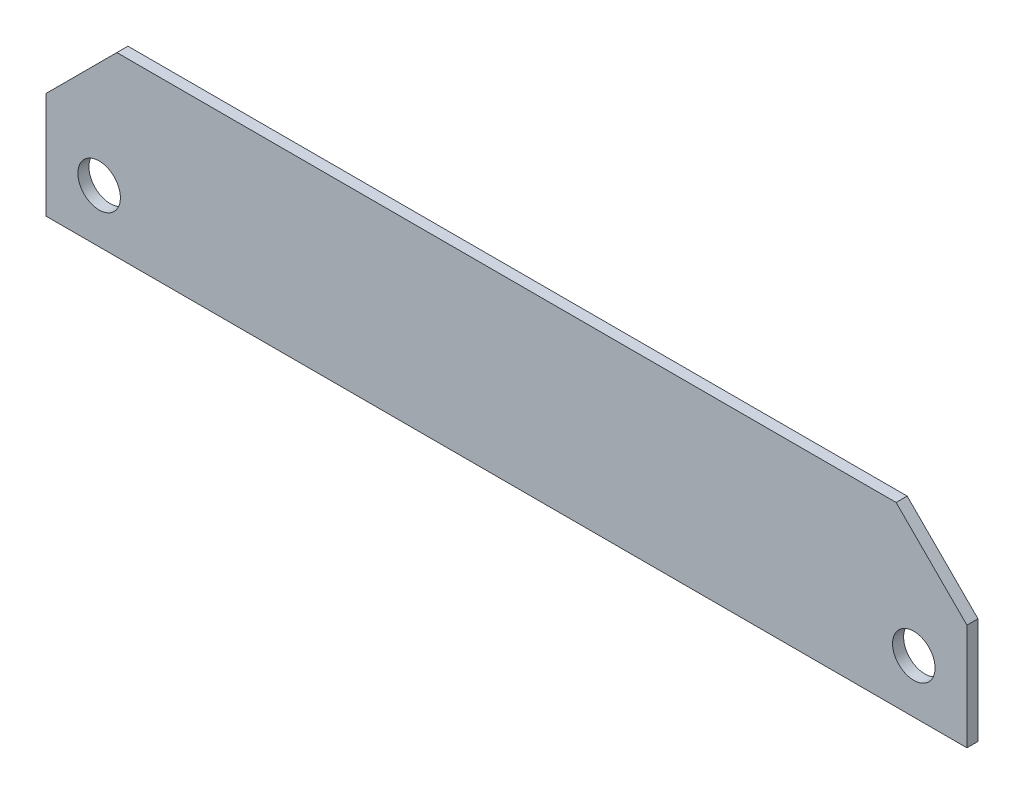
ISO-10303-21;
HEADER;
FILE_DESCRIPTION(('STEP AP214'),'2;1');
FILE_NAME('part.step','',(''),(''),'','','');
FILE_SCHEMA(('AUTOMOTIVE_DESIGN { 1 0 10303 214 1 1 1 1 }'));
ENDSEC;
DATA;
#1=APPLICATION_CONTEXT('core data for automotive mechanical design processes');
#2=APPLICATION_PROTOCOL_DEFINITION('international standard','automotive_design',2000,#1);
#3=PRODUCT_CONTEXT('',#1,'mechanical');
#4=PRODUCT('Part','Part','',(#3));
#5=PRODUCT_RELATED_PRODUCT_CATEGORY('part','',(#4));
#6=PRODUCT_DEFINITION_FORMATION('','',#4);
#7=PRODUCT_DEFINITION_CONTEXT('part definition',#1,'design');
#8=PRODUCT_DEFINITION('design','',#6,#7);
#9=PRODUCT_DEFINITION_SHAPE('','',#8);
#10=(LENGTH_UNIT() NAMED_UNIT(*) SI_UNIT(.MILLI.,.METRE.));
#11=(NAMED_UNIT(*) PLANE_ANGLE_UNIT() SI_UNIT($,.RADIAN.));
#12=(NAMED_UNIT(*) SI_UNIT($,.STERADIAN.) SOLID_ANGLE_UNIT());
#13=UNCERTAINTY_MEASURE_WITH_UNIT(LENGTH_MEASURE(1.E-05),#10,'distance_accuracy_value','');
#14=(GEOMETRIC_REPRESENTATION_CONTEXT(3) GLOBAL_UNCERTAINTY_ASSIGNED_CONTEXT((#13)) GLOBAL_UNIT_ASSIGNED_CONTEXT((#10,
#11,#12)) REPRESENTATION_CONTEXT('',''));
#15=CARTESIAN_POINT('',(0.,0.,0.));
#16=DIRECTION('',(0.,0.,1.));
#17=DIRECTION('',(1.,0.,0.));
#18=AXIS2_PLACEMENT_3D('',#15,#16,#17);
#19=CARTESIAN_POINT('',(0.,0.,0.79375));
#20=DIRECTION('',(1.,0.,0.));
#21=DIRECTION('',(0.,0.,-1.));
#22=AXIS2_PLACEMENT_3D('',#19,#20,#21);
#23=PLANE('',#22);
#24=DIRECTION('',(0.,-1.,0.));
#25=VECTOR('',#24,1.);
#26=CARTESIAN_POINT('',(0.,0.,0.79375));
#27=LINE('',#26,#25);
#28=CARTESIAN_POINT('',(0.,7.62,0.79375));
#29=VERTEX_POINT('',#28);
#30=CARTESIAN_POINT('',(0.,0.,0.79375));
#31=VERTEX_POINT('',#30);
#32=EDGE_CURVE('E136',#29,#31,#27,.T.);
#33=ORIENTED_EDGE('',*,*,#32,.F.);
#34=DIRECTION('',(0.,0.,-1.));
#35=VECTOR('',#34,1.);
#36=CARTESIAN_POINT('',(0.,7.62,0.79375));
#37=LINE('',#36,#35);
#38=CARTESIAN_POINT('',(0.,7.61999999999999,0.));
#39=VERTEX_POINT('',#38);
#40=EDGE_CURVE('E11',#29,#39,#37,.T.);
#41=ORIENTED_EDGE('',*,*,#40,.T.);
#42=DIRECTION('',(0.,-1.,0.));
#43=VECTOR('',#42,1.);
#44=CARTESIAN_POINT('',(0.,0.,0.));
#45=LINE('',#44,#43);
#46=CARTESIAN_POINT('',(0.,0.,0.));
#47=VERTEX_POINT('',#46);
#48=EDGE_CURVE('E86',#39,#47,#45,.T.);
#49=ORIENTED_EDGE('',*,*,#48,.T.);
#50=DIRECTION('',(0.,0.,-1.));
#51=VECTOR('',#50,1.);
#52=CARTESIAN_POINT('',(0.,0.,0.79375));
#53=LINE('',#52,#51);
#54=EDGE_CURVE('E89',#31,#47,#53,.T.);
#55=ORIENTED_EDGE('',*,*,#54,.F.);
#56=EDGE_LOOP('',(#33,#41,#49,#55));
#57=FACE_BOUND('',#56,.T.);
#58=ADVANCED_FACE('F31',(#57),#23,.F.);
#59=CARTESIAN_POINT('',(0.,0.,0.79375));
#60=DIRECTION('',(0.,1.,0.));
#61=DIRECTION('',(0.,0.,1.));
#62=AXIS2_PLACEMENT_3D('',#59,#60,#61);
#63=PLANE('',#62);
#64=DIRECTION('',(1.,0.,0.));
#65=VECTOR('',#64,1.);
#66=CARTESIAN_POINT('',(0.,0.,0.));
#67=LINE('',#66,#65);
#68=CARTESIAN_POINT('',(66.04,0.,0.));
#69=VERTEX_POINT('',#68);
#70=EDGE_CURVE('E92',#47,#69,#67,.T.);
#71=ORIENTED_EDGE('',*,*,#70,.T.);
#72=DIRECTION('',(0.,0.,-1.));
#73=VECTOR('',#72,1.);
#74=CARTESIAN_POINT('',(66.04,0.,0.79375));
#75=LINE('',#74,#73);
#76=CARTESIAN_POINT('',(66.04,0.,0.79375));
#77=VERTEX_POINT('',#76);
#78=EDGE_CURVE('E107',#77,#69,#75,.T.);
#79=ORIENTED_EDGE('',*,*,#78,.F.);
#80=DIRECTION('',(1.,0.,0.));
#81=VECTOR('',#80,1.);
#82=CARTESIAN_POINT('',(0.,0.,0.79375));
#83=LINE('',#82,#81);
#84=EDGE_CURVE('E105',#31,#77,#83,.T.);
#85=ORIENTED_EDGE('',*,*,#84,.F.);
#86=ORIENTED_EDGE('',*,*,#54,.T.);
#87=EDGE_LOOP('',(#71,#79,#85,#86));
#88=FACE_BOUND('',#87,.T.);
#89=ADVANCED_FACE('F104',(#88),#63,.F.);
#90=CARTESIAN_POINT('',(66.04,0.,0.79375));
#91=DIRECTION('',(-1.,0.,0.));
#92=DIRECTION('',(0.,0.,1.));
#93=AXIS2_PLACEMENT_3D('',#90,#91,#92);
#94=PLANE('',#93);
#95=DIRECTION('',(0.,1.,0.));
#96=VECTOR('',#95,1.);
#97=CARTESIAN_POINT('',(66.04,0.,0.));
#98=LINE('',#97,#96);
#99=CARTESIAN_POINT('',(66.04,7.61999999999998,0.));
#100=VERTEX_POINT('',#99);
#101=EDGE_CURVE('E98',#69,#100,#98,.T.);
#102=ORIENTED_EDGE('',*,*,#101,.T.);
#103=DIRECTION('',(0.,0.,1.));
#104=VECTOR('',#103,1.);
#105=CARTESIAN_POINT('',(66.04,7.61999999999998,0.79375));
#106=LINE('',#105,#104);
#107=CARTESIAN_POINT('',(66.04,7.61999999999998,0.79375));
#108=VERTEX_POINT('',#107);
#109=EDGE_CURVE('E53',#100,#108,#106,.T.);
#110=ORIENTED_EDGE('',*,*,#109,.T.);
#111=DIRECTION('',(0.,1.,0.));
#112=VECTOR('',#111,1.);
#113=CARTESIAN_POINT('',(66.04,0.,0.79375));
#114=LINE('',#113,#112);
#115=EDGE_CURVE('E125',#77,#108,#114,.T.);
#116=ORIENTED_EDGE('',*,*,#115,.F.);
#117=ORIENTED_EDGE('',*,*,#78,.T.);
#118=EDGE_LOOP('',(#102,#110,#116,#117));
#119=FACE_BOUND('',#118,.T.);
#120=ADVANCED_FACE('F134',(#119),#94,.F.);
#121=CARTESIAN_POINT('',(0.,12.7,0.79375));
#122=DIRECTION('',(0.,-1.,0.));
#123=DIRECTION('',(0.,0.,-1.));
#124=AXIS2_PLACEMENT_3D('',#121,#122,#123);
#125=PLANE('',#124);
#126=DIRECTION('',(-1.,0.,0.));
#127=VECTOR('',#126,1.);
#128=CARTESIAN_POINT('',(0.,12.7,0.79375));
#129=LINE('',#128,#127);
#130=CARTESIAN_POINT('',(60.96,12.7,0.79375));
#131=VERTEX_POINT('',#130);
#132=CARTESIAN_POINT('',(5.08000000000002,12.7,0.79375));
#133=VERTEX_POINT('',#132);
#134=EDGE_CURVE('E111',#131,#133,#129,.T.);
#135=ORIENTED_EDGE('',*,*,#134,.F.);
#136=DIRECTION('',(0.,0.,-1.));
#137=VECTOR('',#136,1.);
#138=CARTESIAN_POINT('',(60.96,12.7,0.79375));
#139=LINE('',#138,#137);
#140=CARTESIAN_POINT('',(60.96,12.7,0.));
#141=VERTEX_POINT('',#140);
#142=EDGE_CURVE('E109',#131,#141,#139,.T.);
#143=ORIENTED_EDGE('',*,*,#142,.T.);
#144=DIRECTION('',(-1.,0.,0.));
#145=VECTOR('',#144,1.);
#146=CARTESIAN_POINT('',(0.,12.7,0.));
#147=LINE('',#146,#145);
#148=CARTESIAN_POINT('',(5.08000000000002,12.7,0.));
#149=VERTEX_POINT('',#148);
#150=EDGE_CURVE('E133',#141,#149,#147,.T.);
#151=ORIENTED_EDGE('',*,*,#150,.T.);
#152=DIRECTION('',(0.,0.,1.));
#153=VECTOR('',#152,1.);
#154=CARTESIAN_POINT('',(5.08000000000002,12.7,0.79375));
#155=LINE('',#154,#153);
#156=EDGE_CURVE('E106',#149,#133,#155,.T.);
#157=ORIENTED_EDGE('',*,*,#156,.T.);
#158=EDGE_LOOP('',(#135,#143,#151,#157));
#159=FACE_BOUND('',#158,.T.);
#160=ADVANCED_FACE('F129',(#159),#125,.F.);
#161=CARTESIAN_POINT('',(0.,12.7,0.79375));
#162=DIRECTION('',(0.,0.,-1.));
#163=DIRECTION('',(-1.,0.,0.));
#164=AXIS2_PLACEMENT_3D('',#161,#162,#163);
#165=PLANE('',#164);
#166=CARTESIAN_POINT('',(62.23,3.81000000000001,0.79375));
#167=DIRECTION('',(0.,0.,1.));
#168=DIRECTION('',(-1.,0.,0.));
#169=AXIS2_PLACEMENT_3D('',#166,#167,#168);
#170=CIRCLE('',#169,1.524);
#171=CARTESIAN_POINT('',(60.706,3.81000000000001,0.79375));
#172=VERTEX_POINT('',#171);
#173=EDGE_CURVE('E181',#172,#172,#170,.T.);
#174=ORIENTED_EDGE('',*,*,#173,.F.);
#175=EDGE_LOOP('',(#174));
#176=FACE_BOUND('',#175,.T.);
#177=CARTESIAN_POINT('',(3.81,3.81,0.79375));
#178=DIRECTION('',(0.,0.,1.));
#179=DIRECTION('',(1.,0.,0.));
#180=AXIS2_PLACEMENT_3D('',#177,#178,#179);
#181=CIRCLE('',#180,1.524);
#182=CARTESIAN_POINT('',(5.334,3.81,0.79375));
#183=VERTEX_POINT('',#182);
#184=EDGE_CURVE('E183',#183,#183,#181,.T.);
#185=ORIENTED_EDGE('',*,*,#184,.F.);
#186=EDGE_LOOP('',(#185));
#187=FACE_BOUND('',#186,.T.);
#188=ORIENTED_EDGE('',*,*,#115,.T.);
#189=DIRECTION('',(0.707106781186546,-0.707106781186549,0.));
#190=VECTOR('',#189,1.);
#191=CARTESIAN_POINT('',(60.96,12.7,0.79375));
#192=LINE('',#191,#190);
#193=EDGE_CURVE('E38',#108,#131,#192,.F.);
#194=ORIENTED_EDGE('',*,*,#193,.T.);
#195=ORIENTED_EDGE('',*,*,#134,.T.);
#196=DIRECTION('',(0.707106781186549,0.707106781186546,0.));
#197=VECTOR('',#196,1.);
#198=CARTESIAN_POINT('',(0.,7.62,0.79375));
#199=LINE('',#198,#197);
#200=EDGE_CURVE('E45',#133,#29,#199,.F.);
#201=ORIENTED_EDGE('',*,*,#200,.T.);
#202=ORIENTED_EDGE('',*,*,#32,.T.);
#203=ORIENTED_EDGE('',*,*,#84,.T.);
#204=EDGE_LOOP('',(#188,#194,#195,#201,#202,#203));
#205=FACE_BOUND('',#204,.T.);
#206=ADVANCED_FACE('F124',(#176,#187,#205),#165,.F.);
#207=CARTESIAN_POINT('',(0.,12.7,0.));
#208=DIRECTION('',(0.,0.,-1.));
#209=DIRECTION('',(-1.,0.,0.));
#210=AXIS2_PLACEMENT_3D('',#207,#208,#209);
#211=PLANE('',#210);
#212=CARTESIAN_POINT('',(62.23,3.81000000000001,0.));
#213=DIRECTION('',(0.,0.,1.));
#214=DIRECTION('',(-1.,0.,0.));
#215=AXIS2_PLACEMENT_3D('',#212,#213,#214);
#216=CIRCLE('',#215,1.524);
#217=CARTESIAN_POINT('',(60.706,3.81000000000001,0.));
#218=VERTEX_POINT('',#217);
#219=EDGE_CURVE('E178',#218,#218,#216,.T.);
#220=ORIENTED_EDGE('',*,*,#219,.T.);
#221=EDGE_LOOP('',(#220));
#222=FACE_BOUND('',#221,.T.);
#223=CARTESIAN_POINT('',(3.81,3.81,0.));
#224=DIRECTION('',(0.,0.,1.));
#225=DIRECTION('',(1.,0.,0.));
#226=AXIS2_PLACEMENT_3D('',#223,#224,#225);
#227=CIRCLE('',#226,1.524);
#228=CARTESIAN_POINT('',(5.334,3.81,0.));
#229=VERTEX_POINT('',#228);
#230=EDGE_CURVE('E93',#229,#229,#227,.T.);
#231=ORIENTED_EDGE('',*,*,#230,.T.);
#232=EDGE_LOOP('',(#231));
#233=FACE_BOUND('',#232,.T.);
#234=ORIENTED_EDGE('',*,*,#150,.F.);
#235=DIRECTION('',(-0.707106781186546,0.707106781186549,0.));
#236=VECTOR('',#235,1.);
#237=CARTESIAN_POINT('',(30.4800000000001,43.18,0.));
#238=LINE('',#237,#236);
#239=EDGE_CURVE('E119',#141,#100,#238,.F.);
#240=ORIENTED_EDGE('',*,*,#239,.T.);
#241=ORIENTED_EDGE('',*,*,#101,.F.);
#242=ORIENTED_EDGE('',*,*,#70,.F.);
#243=ORIENTED_EDGE('',*,*,#48,.F.);
#244=DIRECTION('',(-0.707106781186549,-0.707106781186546,0.));
#245=VECTOR('',#244,1.);
#246=CARTESIAN_POINT('',(2.54,10.16,0.));
#247=LINE('',#246,#245);
#248=EDGE_CURVE('E117',#39,#149,#247,.F.);
#249=ORIENTED_EDGE('',*,*,#248,.T.);
#250=EDGE_LOOP('',(#234,#240,#241,#242,#243,#249));
#251=FACE_BOUND('',#250,.T.);
#252=ADVANCED_FACE('F97',(#222,#233,#251),#211,.T.);
#253=CARTESIAN_POINT('',(3.81,3.81,0.));
#254=DIRECTION('',(0.,0.,1.));
#255=DIRECTION('',(1.,0.,0.));
#256=AXIS2_PLACEMENT_3D('',#253,#254,#255);
#257=CYLINDRICAL_SURFACE('',#256,1.524);
#258=ORIENTED_EDGE('',*,*,#230,.F.);
#259=EDGE_LOOP('',(#258));
#260=FACE_BOUND('',#259,.T.);
#261=ORIENTED_EDGE('',*,*,#184,.T.);
#262=EDGE_LOOP('',(#261));
#263=FACE_BOUND('',#262,.T.);
#264=ADVANCED_FACE('F166',(#260,#263),#257,.F.);
#265=CARTESIAN_POINT('',(62.23,3.81000000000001,0.));
#266=DIRECTION('',(0.,0.,1.));
#267=DIRECTION('',(1.,0.,0.));
#268=AXIS2_PLACEMENT_3D('',#265,#266,#267);
#269=CYLINDRICAL_SURFACE('',#268,1.524);
#270=ORIENTED_EDGE('',*,*,#219,.F.);
#271=EDGE_LOOP('',(#270));
#272=FACE_BOUND('',#271,.T.);
#273=ORIENTED_EDGE('',*,*,#173,.T.);
#274=EDGE_LOOP('',(#273));
#275=FACE_BOUND('',#274,.T.);
#276=ADVANCED_FACE('F148',(#272,#275),#269,.F.);
#277=CARTESIAN_POINT('',(60.96,12.7,0.79375));
#278=DIRECTION('',(-0.707106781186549,-0.707106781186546,0.));
#279=DIRECTION('',(0.707106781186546,-0.707106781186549,0.));
#280=AXIS2_PLACEMENT_3D('',#277,#278,#279);
#281=PLANE('',#280);
#282=ORIENTED_EDGE('',*,*,#193,.F.);
#283=ORIENTED_EDGE('',*,*,#109,.F.);
#284=ORIENTED_EDGE('',*,*,#239,.F.);
#285=ORIENTED_EDGE('',*,*,#142,.F.);
#286=EDGE_LOOP('',(#282,#283,#284,#285));
#287=FACE_BOUND('',#286,.T.);
#288=ADVANCED_FACE('F132',(#287),#281,.F.);
#289=CARTESIAN_POINT('',(0.,7.62,0.79375));
#290=DIRECTION('',(0.707106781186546,-0.707106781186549,0.));
#291=DIRECTION('',(0.707106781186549,0.707106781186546,0.));
#292=AXIS2_PLACEMENT_3D('',#289,#290,#291);
#293=PLANE('',#292);
#294=ORIENTED_EDGE('',*,*,#200,.F.);
#295=ORIENTED_EDGE('',*,*,#156,.F.);
#296=ORIENTED_EDGE('',*,*,#248,.F.);
#297=ORIENTED_EDGE('',*,*,#40,.F.);
#298=EDGE_LOOP('',(#294,#295,#296,#297));
#299=FACE_BOUND('',#298,.T.);
#300=ADVANCED_FACE('F142',(#299),#293,.F.);
#301=CLOSED_SHELL('',(#58,#89,#120,#160,#206,#252,#264,#276,#288,#300));
#302=MANIFOLD_SOLID_BREP('B2',#301);
#303=ADVANCED_BREP_SHAPE_REPRESENTATION('',(#18,#302),#14);
#304=SHAPE_DEFINITION_REPRESENTATION(#9,#303);
ENDSEC;
END-ISO-10303-21;
